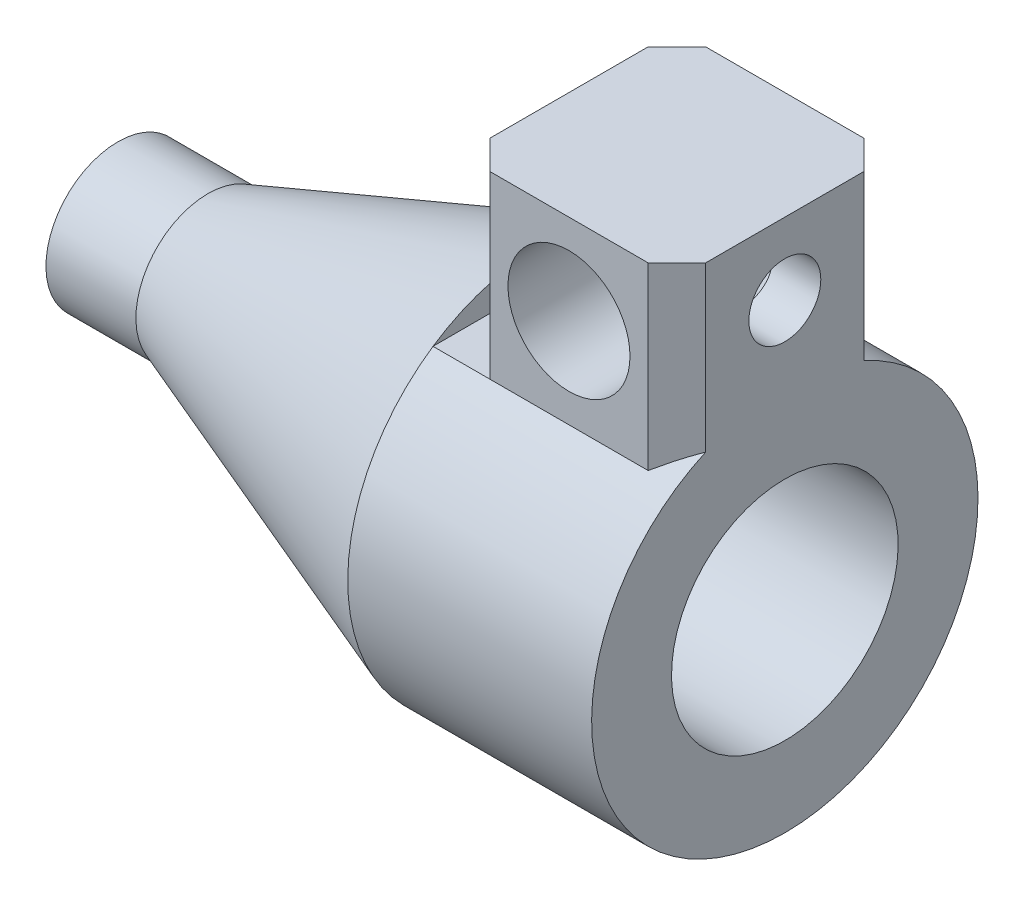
from build123d import *

# Parameters (mm, degrees)
CUT_EXTRUDE1_START          = -43.053
CUT_EXTRUDE1_DEPTH          = 43.053
SKETCH4_W                   = 38.1
SKETCH4_H                   = 31.75
BOSS_EXTRUDE1_DEPTH         = 38.1
F_1_4_0_25_DIAMETER_HOLE1_D = 12.7
CHAMFER1_SIZE               = 5.08
SKETCH9_R                   = 10.7696
CUT_EXTRUDE2_DEPTH          = 143.430825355


with BuildPart() as part:
    # Sketch1 → Revolve1 (revolve)
    with BuildSketch(Plane.XY):
        Polygon((-41.91, 20.0025), (0, 20.0025), (0, 29.337), (0, 34.0995), (-43.049623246, 34.0995), (-101.844266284, 12.7), (-117.719266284, 12.7), (-117.719266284, 1.5), (-91.127423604, 1.5), (-84.39778467, 12.7), (-46.29778467, 12.7), align=None)
    revolve(axis=Axis((101.6, 0, 0), (-1, 0, 0)))

    # Sketch3 → Cut-Extrude1 (cut)
    with BuildSketch(Plane(origin=(0, 0, 0), x_dir=(0, 0, -1), z_dir=(1, 0, 0)).offset(CUT_EXTRUDE1_START)):
        with BuildLine():
            ThreePointArc((1.9e-07, 34.0995), (-9.959234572, 32.612720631), (-19.05, 28.28203317))
            Line((-19.05, 28.28203317), (19.05, 28.28203317))
            ThreePointArc((19.05, 28.28203317), (9.959234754, 32.612720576), (1.9e-07, 34.0995))
        make_face()
    extrude(amount=CUT_EXTRUDE1_DEPTH, mode=Mode.SUBTRACT)

    # Sketch4 → Boss-Extrude1 (add)
    with BuildSketch(Plane(origin=(0, 0, 0), x_dir=(0, 0, -1), z_dir=(1, 0, 0))):
        with Locations((0, 44.15703317)):
            Rectangle(SKETCH4_W, SKETCH4_H)
    extrude(amount=-BOSS_EXTRUDE1_DEPTH)

    # 1_4 _0.25_ Diameter Hole1 (through all)
    with Locations(Plane(origin=(0, 0, 0), x_dir=(0, 0, -1), z_dir=(1, 0, 0))):
        with Locations((0, 47.33203317)):
            Hole(F_1_4_0_25_DIAMETER_HOLE1_D / 2)

    # Chamfer1
    chamfer1_edges = [part.edges().sort_by_distance(p)[0] for p in [
        (-38.1, 44.15703317, -19.05),
        (-38.1, 44.15703317, 19.05),
        (0, 44.15703317, -19.05),
        (0, 44.15703317, 19.05),
    ]]
    chamfer(chamfer1_edges, length=CHAMFER1_SIZE)

    # Sketch9 → Cut-Extrude2 (cut, through all)
    with BuildSketch(Plane(origin=(0, 0, -19.05), x_dir=(-1, 0, 0), z_dir=(0, 0, -1))):
        with Locations(Location((19.05, 44.15703317, 0), (0, 0, 90))):
            Circle(SKETCH9_R)
    extrude(amount=-CUT_EXTRUDE2_DEPTH, mode=Mode.SUBTRACT)


solid = part.part
